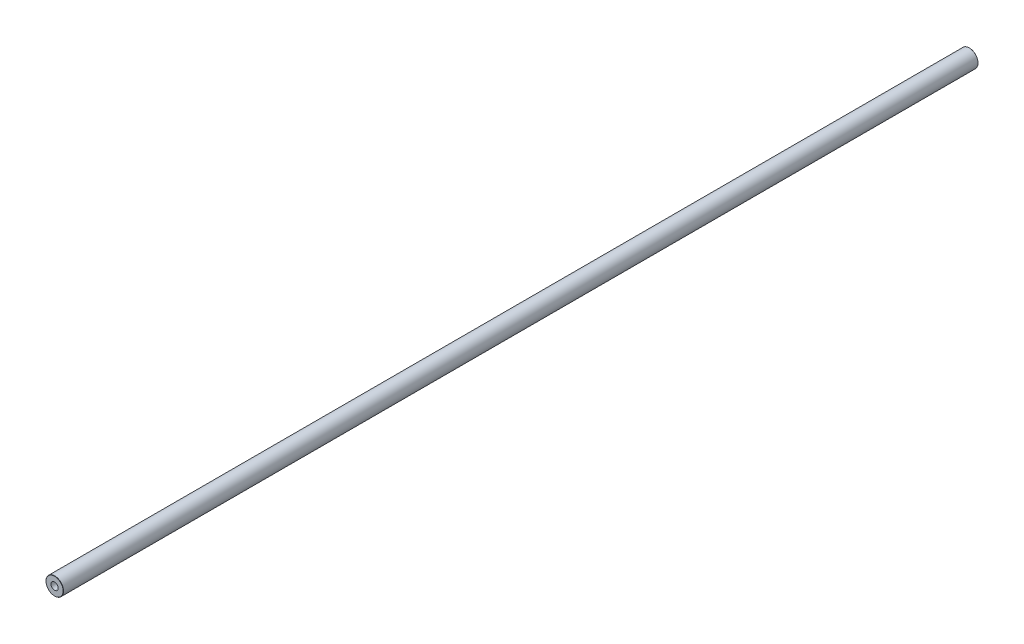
ISO-10303-21;
HEADER;
FILE_DESCRIPTION(('STEP AP214'),'2;1');
FILE_NAME('part.step','',(''),(''),'','','');
FILE_SCHEMA(('AUTOMOTIVE_DESIGN { 1 0 10303 214 1 1 1 1 }'));
ENDSEC;
DATA;
#1=APPLICATION_CONTEXT('core data for automotive mechanical design processes');
#2=APPLICATION_PROTOCOL_DEFINITION('international standard','automotive_design',2000,#1);
#3=PRODUCT_CONTEXT('',#1,'mechanical');
#4=PRODUCT('Part','Part','',(#3));
#5=PRODUCT_RELATED_PRODUCT_CATEGORY('part','',(#4));
#6=PRODUCT_DEFINITION_FORMATION('','',#4);
#7=PRODUCT_DEFINITION_CONTEXT('part definition',#1,'design');
#8=PRODUCT_DEFINITION('design','',#6,#7);
#9=PRODUCT_DEFINITION_SHAPE('','',#8);
#10=(LENGTH_UNIT() NAMED_UNIT(*) SI_UNIT(.MILLI.,.METRE.));
#11=(NAMED_UNIT(*) PLANE_ANGLE_UNIT() SI_UNIT($,.RADIAN.));
#12=(NAMED_UNIT(*) SI_UNIT($,.STERADIAN.) SOLID_ANGLE_UNIT());
#13=UNCERTAINTY_MEASURE_WITH_UNIT(LENGTH_MEASURE(1.E-05),#10,'distance_accuracy_value','');
#14=(GEOMETRIC_REPRESENTATION_CONTEXT(3) GLOBAL_UNCERTAINTY_ASSIGNED_CONTEXT((#13)) GLOBAL_UNIT_ASSIGNED_CONTEXT((#10,
#11,#12)) REPRESENTATION_CONTEXT('',''));
#15=CARTESIAN_POINT('',(0.,0.,0.));
#16=DIRECTION('',(0.,0.,1.));
#17=DIRECTION('',(1.,0.,0.));
#18=AXIS2_PLACEMENT_3D('',#15,#16,#17);
#19=CARTESIAN_POINT('',(0.,0.,416.9));
#20=DIRECTION('',(0.,0.,-1.));
#21=DIRECTION('',(-1.,0.,0.));
#22=AXIS2_PLACEMENT_3D('',#19,#20,#21);
#23=CYLINDRICAL_SURFACE('',#22,4.);
#24=CARTESIAN_POINT('',(0.,0.,416.8));
#25=DIRECTION('',(0.,0.,1.));
#26=DIRECTION('',(1.,0.,0.));
#27=AXIS2_PLACEMENT_3D('',#24,#25,#26);
#28=CIRCLE('',#27,4.);
#29=CARTESIAN_POINT('',(-4.00000000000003,0.,416.8));
#30=VERTEX_POINT('',#29);
#31=EDGE_CURVE('E57',#30,#30,#28,.F.);
#32=ORIENTED_EDGE('',*,*,#31,.T.);
#33=EDGE_LOOP('',(#32));
#34=FACE_BOUND('',#33,.T.);
#35=CARTESIAN_POINT('',(0.,0.,0.0999999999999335));
#36=DIRECTION('',(0.,0.,1.));
#37=DIRECTION('',(1.,0.,0.));
#38=AXIS2_PLACEMENT_3D('',#35,#36,#37);
#39=CIRCLE('',#38,4.);
#40=CARTESIAN_POINT('',(4.,0.,0.0999999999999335));
#41=VERTEX_POINT('',#40);
#42=EDGE_CURVE('E87',#41,#41,#39,.T.);
#43=ORIENTED_EDGE('',*,*,#42,.T.);
#44=EDGE_LOOP('',(#43));
#45=FACE_BOUND('',#44,.T.);
#46=ADVANCED_FACE('F48',(#34,#45),#23,.T.);
#47=CARTESIAN_POINT('',(0.,0.,416.9));
#48=DIRECTION('',(0.,0.,1.));
#49=DIRECTION('',(1.,0.,0.));
#50=AXIS2_PLACEMENT_3D('',#47,#48,#49);
#51=PLANE('',#50);
#52=CARTESIAN_POINT('',(0.,0.,416.9));
#53=DIRECTION('',(0.,0.,1.));
#54=DIRECTION('',(1.,0.,0.));
#55=AXIS2_PLACEMENT_3D('',#52,#53,#54);
#56=CIRCLE('',#55,3.90000000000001);
#57=CARTESIAN_POINT('',(-3.90000000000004,0.,416.9));
#58=VERTEX_POINT('',#57);
#59=EDGE_CURVE('E84',#58,#58,#56,.T.);
#60=ORIENTED_EDGE('',*,*,#59,.T.);
#61=EDGE_LOOP('',(#60));
#62=FACE_BOUND('',#61,.T.);
#63=CARTESIAN_POINT('',(0.,0.,416.9));
#64=DIRECTION('',(0.,0.,1.));
#65=DIRECTION('',(1.,0.,0.));
#66=AXIS2_PLACEMENT_3D('',#63,#64,#65);
#67=CIRCLE('',#66,1.64999999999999);
#68=CARTESIAN_POINT('',(1.64999999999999,0.,416.9));
#69=VERTEX_POINT('',#68);
#70=EDGE_CURVE('E74',#69,#69,#67,.T.);
#71=ORIENTED_EDGE('',*,*,#70,.F.);
#72=EDGE_LOOP('',(#71));
#73=FACE_BOUND('',#72,.T.);
#74=ADVANCED_FACE('F99',(#62,#73),#51,.T.);
#75=CARTESIAN_POINT('',(0.,0.,0.));
#76=DIRECTION('',(0.,0.,1.));
#77=DIRECTION('',(1.,0.,0.));
#78=AXIS2_PLACEMENT_3D('',#75,#76,#77);
#79=PLANE('',#78);
#80=CARTESIAN_POINT('',(0.,0.,0.));
#81=DIRECTION('',(0.,0.,1.));
#82=DIRECTION('',(1.,0.,0.));
#83=AXIS2_PLACEMENT_3D('',#80,#81,#82);
#84=CIRCLE('',#83,3.90000000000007);
#85=CARTESIAN_POINT('',(3.90000000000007,0.,0.));
#86=VERTEX_POINT('',#85);
#87=EDGE_CURVE('E11',#86,#86,#84,.F.);
#88=ORIENTED_EDGE('',*,*,#87,.T.);
#89=EDGE_LOOP('',(#88));
#90=FACE_BOUND('',#89,.T.);
#91=CARTESIAN_POINT('',(0.,0.,0.));
#92=DIRECTION('',(0.,0.,-1.));
#93=DIRECTION('',(-1.,0.,0.));
#94=AXIS2_PLACEMENT_3D('',#91,#92,#93);
#95=CIRCLE('',#94,1.64999999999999);
#96=CARTESIAN_POINT('',(-1.64999999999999,0.,0.));
#97=VERTEX_POINT('',#96);
#98=EDGE_CURVE('E73',#97,#97,#95,.T.);
#99=ORIENTED_EDGE('',*,*,#98,.F.);
#100=EDGE_LOOP('',(#99));
#101=FACE_BOUND('',#100,.T.);
#102=ADVANCED_FACE('F102',(#90,#101),#79,.F.);
#103=CARTESIAN_POINT('',(0.,0.,20.));
#104=DIRECTION('',(0.,0.,-1.));
#105=DIRECTION('',(-1.,0.,0.));
#106=AXIS2_PLACEMENT_3D('',#103,#104,#105);
#107=CONICAL_SURFACE('',#106,1.65,1.02974425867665);
#108=CARTESIAN_POINT('',(0.,0.,20.9914200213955));
#109=VERTEX_POINT('',#108);
#110=VERTEX_LOOP('',#109);
#111=FACE_BOUND('',#110,.T.);
#112=CARTESIAN_POINT('',(0.,0.,20.));
#113=DIRECTION('',(0.,0.,-1.));
#114=DIRECTION('',(-1.,0.,0.));
#115=AXIS2_PLACEMENT_3D('',#112,#113,#114);
#116=CIRCLE('',#115,1.65);
#117=CARTESIAN_POINT('',(-1.65,0.,20.));
#118=VERTEX_POINT('',#117);
#119=EDGE_CURVE('E77',#118,#118,#116,.T.);
#120=ORIENTED_EDGE('',*,*,#119,.T.);
#121=EDGE_LOOP('',(#120));
#122=FACE_BOUND('',#121,.T.);
#123=ADVANCED_FACE('F121',(#111,#122),#107,.F.);
#124=CARTESIAN_POINT('',(0.,0.,0.));
#125=DIRECTION('',(0.,0.,-1.));
#126=DIRECTION('',(-1.,0.,0.));
#127=AXIS2_PLACEMENT_3D('',#124,#125,#126);
#128=CYLINDRICAL_SURFACE('',#127,1.64999999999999);
#129=ORIENTED_EDGE('',*,*,#119,.F.);
#130=EDGE_LOOP('',(#129));
#131=FACE_BOUND('',#130,.T.);
#132=ORIENTED_EDGE('',*,*,#98,.T.);
#133=EDGE_LOOP('',(#132));
#134=FACE_BOUND('',#133,.T.);
#135=ADVANCED_FACE('F67',(#131,#134),#128,.F.);
#136=CARTESIAN_POINT('',(0.,0.,396.9));
#137=DIRECTION('',(0.,0.,1.));
#138=DIRECTION('',(1.,0.,0.));
#139=AXIS2_PLACEMENT_3D('',#136,#137,#138);
#140=CONICAL_SURFACE('',#139,1.64999999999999,1.02974425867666);
#141=CARTESIAN_POINT('',(0.,0.,395.908579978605));
#142=VERTEX_POINT('',#141);
#143=VERTEX_LOOP('',#142);
#144=FACE_BOUND('',#143,.T.);
#145=CARTESIAN_POINT('',(0.,0.,396.9));
#146=DIRECTION('',(0.,0.,1.));
#147=DIRECTION('',(1.,0.,0.));
#148=AXIS2_PLACEMENT_3D('',#145,#146,#147);
#149=CIRCLE('',#148,1.64999999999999);
#150=CARTESIAN_POINT('',(1.64999999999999,0.,396.9));
#151=VERTEX_POINT('',#150);
#152=EDGE_CURVE('E71',#151,#151,#149,.T.);
#153=ORIENTED_EDGE('',*,*,#152,.T.);
#154=EDGE_LOOP('',(#153));
#155=FACE_BOUND('',#154,.T.);
#156=ADVANCED_FACE('F63',(#144,#155),#140,.F.);
#157=CARTESIAN_POINT('',(0.,0.,416.9));
#158=DIRECTION('',(0.,0.,1.));
#159=DIRECTION('',(1.,0.,0.));
#160=AXIS2_PLACEMENT_3D('',#157,#158,#159);
#161=CYLINDRICAL_SURFACE('',#160,1.64999999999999);
#162=ORIENTED_EDGE('',*,*,#152,.F.);
#163=EDGE_LOOP('',(#162));
#164=FACE_BOUND('',#163,.T.);
#165=ORIENTED_EDGE('',*,*,#70,.T.);
#166=EDGE_LOOP('',(#165));
#167=FACE_BOUND('',#166,.T.);
#168=ADVANCED_FACE('F66',(#164,#167),#161,.F.);
#169=CARTESIAN_POINT('',(0.,0.,416.9));
#170=DIRECTION('',(0.,0.,-1.));
#171=DIRECTION('',(-1.,0.,0.));
#172=AXIS2_PLACEMENT_3D('',#169,#170,#171);
#173=CONICAL_SURFACE('',#172,3.90000000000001,0.785398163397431);
#174=CARTESIAN_POINT('',(-4.00000000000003,0.,416.8));
#175=CARTESIAN_POINT('',(-3.99895833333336,0.,416.801041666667));
#176=CARTESIAN_POINT('',(-3.99791666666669,0.,416.802083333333));
#177=CARTESIAN_POINT('',(-3.99583333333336,0.,416.804166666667));
#178=CARTESIAN_POINT('',(-3.99479166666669,0.,416.805208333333));
#179=CARTESIAN_POINT('',(-3.99270833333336,0.,416.807291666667));
#180=CARTESIAN_POINT('',(-3.9916666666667,0.,416.808333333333));
#181=CARTESIAN_POINT('',(-3.98958333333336,0.,416.810416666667));
#182=CARTESIAN_POINT('',(-3.9885416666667,0.,416.811458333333));
#183=CARTESIAN_POINT('',(-3.98645833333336,0.,416.813541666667));
#184=CARTESIAN_POINT('',(-3.9854166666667,0.,416.814583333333));
#185=CARTESIAN_POINT('',(-3.98333333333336,0.,416.816666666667));
#186=CARTESIAN_POINT('',(-3.9822916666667,0.,416.817708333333));
#187=CARTESIAN_POINT('',(-3.98020833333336,0.,416.819791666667));
#188=CARTESIAN_POINT('',(-3.97916666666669,0.,416.820833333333));
#189=CARTESIAN_POINT('',(-3.97708333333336,0.,416.822916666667));
#190=CARTESIAN_POINT('',(-3.9760416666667,0.,416.823958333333));
#191=CARTESIAN_POINT('',(-3.97395833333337,0.,416.826041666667));
#192=CARTESIAN_POINT('',(-3.9729166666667,0.,416.827083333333));
#193=CARTESIAN_POINT('',(-3.97083333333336,0.,416.829166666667));
#194=CARTESIAN_POINT('',(-3.9697916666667,0.,416.830208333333));
#195=CARTESIAN_POINT('',(-3.96770833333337,0.,416.832291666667));
#196=CARTESIAN_POINT('',(-3.9666666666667,0.,416.833333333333));
#197=CARTESIAN_POINT('',(-3.96458333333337,0.,416.835416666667));
#198=CARTESIAN_POINT('',(-3.9635416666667,0.,416.836458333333));
#199=CARTESIAN_POINT('',(-3.96145833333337,0.,416.838541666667));
#200=CARTESIAN_POINT('',(-3.9604166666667,0.,416.839583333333));
#201=CARTESIAN_POINT('',(-3.95833333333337,0.,416.841666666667));
#202=CARTESIAN_POINT('',(-3.9572916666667,0.,416.842708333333));
#203=CARTESIAN_POINT('',(-3.95520833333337,0.,416.844791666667));
#204=CARTESIAN_POINT('',(-3.9541666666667,0.,416.845833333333));
#205=CARTESIAN_POINT('',(-3.95208333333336,0.,416.847916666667));
#206=CARTESIAN_POINT('',(-3.9510416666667,0.,416.848958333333));
#207=CARTESIAN_POINT('',(-3.94895833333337,0.,416.851041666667));
#208=CARTESIAN_POINT('',(-3.9479166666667,0.,416.852083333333));
#209=CARTESIAN_POINT('',(-3.94583333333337,0.,416.854166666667));
#210=CARTESIAN_POINT('',(-3.9447916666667,0.,416.855208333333));
#211=CARTESIAN_POINT('',(-3.94270833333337,0.,416.857291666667));
#212=CARTESIAN_POINT('',(-3.9416666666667,0.,416.858333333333));
#213=CARTESIAN_POINT('',(-3.93958333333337,0.,416.860416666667));
#214=CARTESIAN_POINT('',(-3.9385416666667,0.,416.861458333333));
#215=CARTESIAN_POINT('',(-3.93645833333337,0.,416.863541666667));
#216=CARTESIAN_POINT('',(-3.9354166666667,0.,416.864583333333));
#217=CARTESIAN_POINT('',(-3.93333333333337,0.,416.866666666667));
#218=CARTESIAN_POINT('',(-3.93229166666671,0.,416.867708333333));
#219=CARTESIAN_POINT('',(-3.93020833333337,0.,416.869791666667));
#220=CARTESIAN_POINT('',(-3.9291666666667,0.,416.870833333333));
#221=CARTESIAN_POINT('',(-3.92708333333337,0.,416.872916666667));
#222=CARTESIAN_POINT('',(-3.92604166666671,0.,416.873958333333));
#223=CARTESIAN_POINT('',(-3.92395833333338,0.,416.876041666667));
#224=CARTESIAN_POINT('',(-3.92291666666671,0.,416.877083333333));
#225=CARTESIAN_POINT('',(-3.92083333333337,0.,416.879166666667));
#226=CARTESIAN_POINT('',(-3.91979166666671,0.,416.880208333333));
#227=CARTESIAN_POINT('',(-3.91770833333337,0.,416.882291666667));
#228=CARTESIAN_POINT('',(-3.91666666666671,0.,416.883333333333));
#229=CARTESIAN_POINT('',(-3.91458333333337,0.,416.885416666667));
#230=CARTESIAN_POINT('',(-3.91354166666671,0.,416.886458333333));
#231=CARTESIAN_POINT('',(-3.91145833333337,0.,416.888541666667));
#232=CARTESIAN_POINT('',(-3.91041666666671,0.,416.889583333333));
#233=CARTESIAN_POINT('',(-3.90833333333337,0.,416.891666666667));
#234=CARTESIAN_POINT('',(-3.90729166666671,0.,416.892708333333));
#235=CARTESIAN_POINT('',(-3.90520833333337,0.,416.894791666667));
#236=CARTESIAN_POINT('',(-3.90416666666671,0.,416.895833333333));
#237=CARTESIAN_POINT('',(-3.90208333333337,0.,416.897916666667));
#238=CARTESIAN_POINT('',(-3.9010416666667,0.,416.898958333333));
#239=CARTESIAN_POINT('',(-3.90000000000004,0.,416.9));
#240=B_SPLINE_CURVE_WITH_KNOTS('',3,(#174,#175,#176,#177,#178,#179,#180,#181,#182,#183,#184,
#185,#186,#187,#188,#189,#190,#191,#192,#193,#194,#195,#196,#197,#198,#199,#200,#201,#202,#203,
#204,#205,#206,#207,#208,#209,#210,#211,#212,#213,#214,#215,#216,#217,#218,#219,#220,#221,#222,
#223,#224,#225,#226,#227,#228,#229,#230,#231,#232,#233,#234,#235,#236,#237,#238,#239),
.UNSPECIFIED.,.F.,.F.,(4,2,2,2,2,2,2,2,2,2,2,2,2,2,2,2,2,2,2,2,2,2,2,2,2,2,2,2,2,2,2,2,4),(0.,
0.00441941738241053,0.00883883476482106,0.0132582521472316,0.0176776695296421,0.022097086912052,
0.0265165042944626,0.0309359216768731,0.0353553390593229,0.0397747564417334,0.0441941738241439,
0.0486135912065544,0.0530330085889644,0.0574524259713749,0.0618718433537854,0.066291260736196,
0.0707106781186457,0.0751300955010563,0.0795495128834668,0.0839689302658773,0.0883883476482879,
0.0928077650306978,0.0972271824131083,0.101646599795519,0.106066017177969,0.110485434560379,
0.11490485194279,0.1193242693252,0.12374368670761,0.128163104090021,0.132582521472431,
0.137001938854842,0.141421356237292),.UNSPECIFIED.);
#241=EDGE_CURVE('BSEAM94',#30,#58,#240,.T.);
#242=ORIENTED_EDGE('',*,*,#31,.F.);
#243=ORIENTED_EDGE('',*,*,#59,.F.);
#244=ORIENTED_EDGE('',*,*,#241,.T.);
#245=ORIENTED_EDGE('',*,*,#241,.F.);
#246=EDGE_LOOP('',(#242,#244,#243,#245));
#247=FACE_BOUND('',#246,.T.);
#248=ADVANCED_FACE('F94',(#247),#173,.T.);
#249=CARTESIAN_POINT('',(0.,0.,0.0999999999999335));
#250=DIRECTION('',(0.,0.,1.));
#251=DIRECTION('',(1.,0.,0.));
#252=AXIS2_PLACEMENT_3D('',#249,#250,#251);
#253=CONICAL_SURFACE('',#252,4.,0.785398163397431);
#254=ORIENTED_EDGE('',*,*,#87,.F.);
#255=EDGE_LOOP('',(#254));
#256=FACE_BOUND('',#255,.T.);
#257=ORIENTED_EDGE('',*,*,#42,.F.);
#258=EDGE_LOOP('',(#257));
#259=FACE_BOUND('',#258,.T.);
#260=ADVANCED_FACE('F51',(#256,#259),#253,.T.);
#261=CLOSED_SHELL('',(#46,#74,#102,#123,#135,#156,#168,#248,#260));
#262=MANIFOLD_SOLID_BREP('B2',#261);
#263=ADVANCED_BREP_SHAPE_REPRESENTATION('',(#18,#262),#14);
#264=SHAPE_DEFINITION_REPRESENTATION(#9,#263);
ENDSEC;
END-ISO-10303-21;
